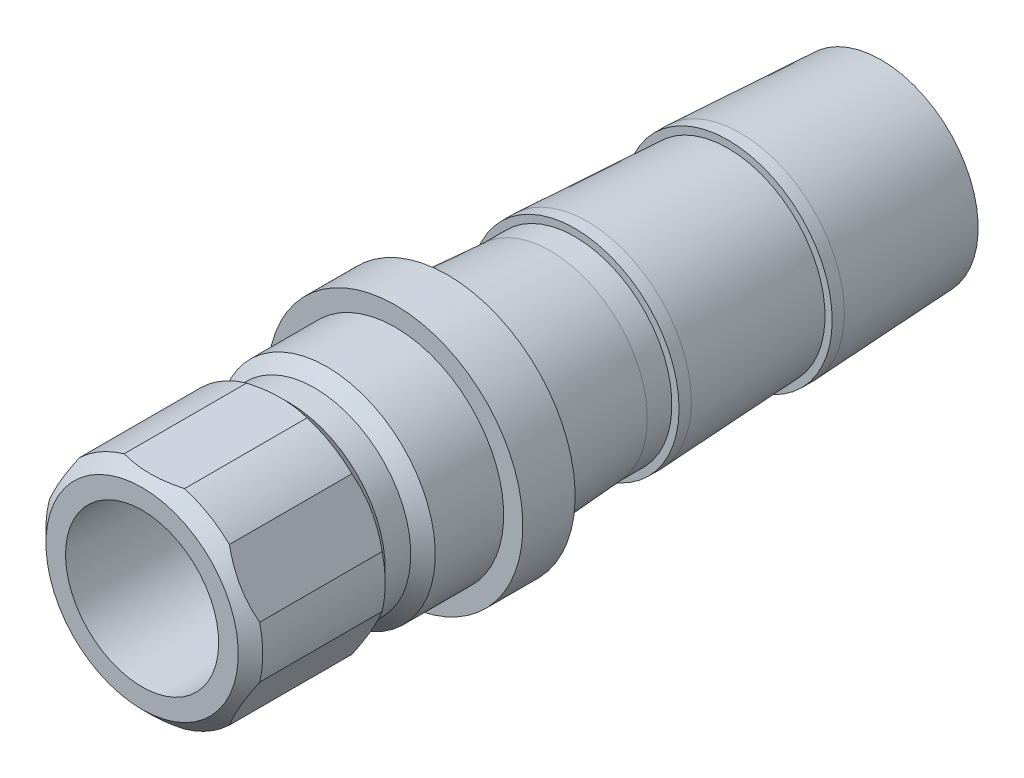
from build123d import *

# Parameters (mm, degrees)
SKETCH2_OUTSIDE_W  = 28.106
SKETCH2_OUTSIDE_H  = 28.107
CUT_EXTRUDE1_DEPTH = 9.525


with BuildPart() as part:
    # Sketch1 → Revolve1 (revolve)
    with BuildSketch(Plane(origin=(0, 0, 0), x_dir=(0, 0, -1), z_dir=(1, 0, 0))):
        Polygon((-15.748, 4.7625), (-15.748, 5.9817), (-14.986, 6.7437), (-7.366, 6.7437), (-6.604, 5.9817), (-5.0165, 5.9817), (-4.2545, 6.7437), (0, 6.7437), (0, 7.9375), (3.2512, 7.9375), (3.2512, 6.477), (9.652, 6.0325), (11.176, 6.0325), (11.176, 6.477), (11.938, 6.477), (20.701, 6.0325), (20.701, 6.477), (21.463, 6.477), (30.226, 6.0325), (30.226, 4.365625), (-0.691870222, 4.365625), (-3.556, 4.7625), align=None)
    revolve(axis=Axis((0, 0, 0), (0, 0, 1)))

    # Sketch2 outside → Cut-Extrude1 (cut)
    with BuildSketch(Plane.XY.offset(15.748)):
        with Locations((0, 0.0005)):
            Rectangle(SKETCH2_OUTSIDE_W, SKETCH2_OUTSIDE_H)
        Polygon((-3.739497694, 6.477), (-7.478995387, 0), (-3.739497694, -6.477), (3.739497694, -6.477), (7.478995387, 0), (3.739497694, 6.477), align=None, mode=Mode.SUBTRACT)
    extrude(amount=-CUT_EXTRUDE1_DEPTH, mode=Mode.SUBTRACT)


solid = part.part
